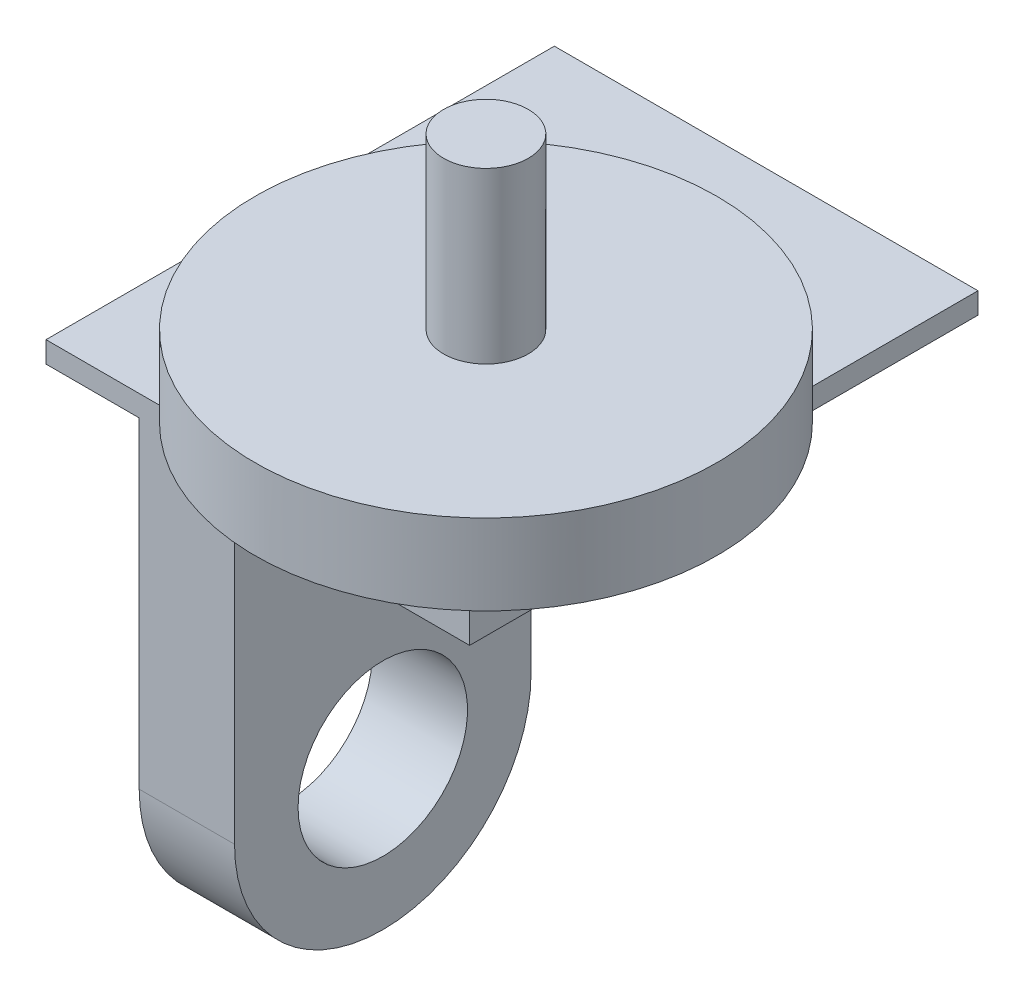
ISO-10303-21;
HEADER;
FILE_DESCRIPTION(('STEP AP214'),'2;1');
FILE_NAME('part.step','',(''),(''),'','','');
FILE_SCHEMA(('AUTOMOTIVE_DESIGN { 1 0 10303 214 1 1 1 1 }'));
ENDSEC;
DATA;
#1=APPLICATION_CONTEXT('core data for automotive mechanical design processes');
#2=APPLICATION_PROTOCOL_DEFINITION('international standard','automotive_design',2000,#1);
#3=PRODUCT_CONTEXT('',#1,'mechanical');
#4=PRODUCT('Part','Part','',(#3));
#5=PRODUCT_RELATED_PRODUCT_CATEGORY('part','',(#4));
#6=PRODUCT_DEFINITION_FORMATION('','',#4);
#7=PRODUCT_DEFINITION_CONTEXT('part definition',#1,'design');
#8=PRODUCT_DEFINITION('design','',#6,#7);
#9=PRODUCT_DEFINITION_SHAPE('','',#8);
#10=(LENGTH_UNIT() NAMED_UNIT(*) SI_UNIT(.MILLI.,.METRE.));
#11=(NAMED_UNIT(*) PLANE_ANGLE_UNIT() SI_UNIT($,.RADIAN.));
#12=(NAMED_UNIT(*) SI_UNIT($,.STERADIAN.) SOLID_ANGLE_UNIT());
#13=UNCERTAINTY_MEASURE_WITH_UNIT(LENGTH_MEASURE(1.E-05),#10,'distance_accuracy_value','');
#14=(GEOMETRIC_REPRESENTATION_CONTEXT(3) GLOBAL_UNCERTAINTY_ASSIGNED_CONTEXT((#13)) GLOBAL_UNIT_ASSIGNED_CONTEXT((#10,
#11,#12)) REPRESENTATION_CONTEXT('',''));
#15=CARTESIAN_POINT('',(0.,0.,0.));
#16=DIRECTION('',(0.,0.,1.));
#17=DIRECTION('',(1.,0.,0.));
#18=AXIS2_PLACEMENT_3D('',#15,#16,#17);
#19=CARTESIAN_POINT('',(0.,0.,0.));
#20=DIRECTION('',(1.,0.,0.));
#21=DIRECTION('',(0.,0.,-1.));
#22=AXIS2_PLACEMENT_3D('',#19,#20,#21);
#23=PLANE('',#22);
#24=CARTESIAN_POINT('',(0.,0.,0.));
#25=DIRECTION('',(1.,0.,0.));
#26=DIRECTION('',(0.,0.,-1.));
#27=AXIS2_PLACEMENT_3D('',#24,#25,#26);
#28=CIRCLE('',#27,40.);
#29=CARTESIAN_POINT('',(0.,0.,40.));
#30=VERTEX_POINT('',#29);
#31=EDGE_CURVE('E194',#30,#30,#28,.T.);
#32=ORIENTED_EDGE('',*,*,#31,.T.);
#33=EDGE_LOOP('',(#32));
#34=FACE_BOUND('',#33,.T.);
#35=DIRECTION('',(0.,0.,1.));
#36=VECTOR('',#35,1.);
#37=CARTESIAN_POINT('',(0.,151.8,0.));
#38=LINE('',#37,#36);
#39=CARTESIAN_POINT('',(0.,151.8,-70.));
#40=VERTEX_POINT('',#39);
#41=CARTESIAN_POINT('',(0.,151.8,70.));
#42=VERTEX_POINT('',#41);
#43=EDGE_CURVE('E171',#40,#42,#38,.T.);
#44=ORIENTED_EDGE('',*,*,#43,.F.);
#45=DIRECTION('',(0.,1.,0.));
#46=VECTOR('',#45,1.);
#47=CARTESIAN_POINT('',(0.,136.8,-70.));
#48=LINE('',#47,#46);
#49=CARTESIAN_POINT('',(0.,0.,-70.));
#50=VERTEX_POINT('',#49);
#51=EDGE_CURVE('E210',#50,#40,#48,.T.);
#52=ORIENTED_EDGE('',*,*,#51,.F.);
#53=CARTESIAN_POINT('',(0.,0.,0.));
#54=DIRECTION('',(1.,0.,0.));
#55=DIRECTION('',(0.,0.,-1.));
#56=AXIS2_PLACEMENT_3D('',#53,#54,#55);
#57=CIRCLE('',#56,70.);
#58=CARTESIAN_POINT('',(0.,0.,70.));
#59=VERTEX_POINT('',#58);
#60=EDGE_CURVE('E198',#59,#50,#57,.T.);
#61=ORIENTED_EDGE('',*,*,#60,.F.);
#62=DIRECTION('',(0.,-1.,0.));
#63=VECTOR('',#62,1.);
#64=CARTESIAN_POINT('',(0.,0.,70.));
#65=LINE('',#64,#63);
#66=EDGE_CURVE('E71',#42,#59,#65,.T.);
#67=ORIENTED_EDGE('',*,*,#66,.F.);
#68=EDGE_LOOP('',(#44,#52,#61,#67));
#69=FACE_BOUND('',#68,.T.);
#70=ADVANCED_FACE('F34',(#34,#69),#23,.F.);
#71=CARTESIAN_POINT('',(45.,136.8,-70.));
#72=DIRECTION('',(0.,0.,1.));
#73=DIRECTION('',(1.,0.,0.));
#74=AXIS2_PLACEMENT_3D('',#71,#72,#73);
#75=PLANE('',#74);
#76=DIRECTION('',(-1.,0.,0.));
#77=VECTOR('',#76,1.);
#78=CARTESIAN_POINT('',(0.,151.8,-70.));
#79=LINE('',#78,#77);
#80=CARTESIAN_POINT('',(156.,151.8,-70.));
#81=VERTEX_POINT('',#80);
#82=EDGE_CURVE('E173',#81,#40,#79,.T.);
#83=ORIENTED_EDGE('',*,*,#82,.F.);
#84=DIRECTION('',(0.,-1.,0.));
#85=VECTOR('',#84,1.);
#86=CARTESIAN_POINT('',(156.,161.8,-70.));
#87=LINE('',#86,#85);
#88=CARTESIAN_POINT('',(156.,136.8,-70.));
#89=VERTEX_POINT('',#88);
#90=EDGE_CURVE('E186',#81,#89,#87,.T.);
#91=ORIENTED_EDGE('',*,*,#90,.T.);
#92=DIRECTION('',(-1.,0.,0.));
#93=VECTOR('',#92,1.);
#94=CARTESIAN_POINT('',(0.,136.8,-70.));
#95=LINE('',#94,#93);
#96=CARTESIAN_POINT('',(45.,136.8,-70.));
#97=VERTEX_POINT('',#96);
#98=EDGE_CURVE('E138',#89,#97,#95,.T.);
#99=ORIENTED_EDGE('',*,*,#98,.T.);
#100=DIRECTION('',(0.,1.,0.));
#101=VECTOR('',#100,1.);
#102=CARTESIAN_POINT('',(45.,136.8,-70.));
#103=LINE('',#102,#101);
#104=CARTESIAN_POINT('',(45.,0.,-70.));
#105=VERTEX_POINT('',#104);
#106=EDGE_CURVE('E78',#105,#97,#103,.T.);
#107=ORIENTED_EDGE('',*,*,#106,.F.);
#108=DIRECTION('',(-1.,0.,0.));
#109=VECTOR('',#108,1.);
#110=CARTESIAN_POINT('',(45.,0.,-70.));
#111=LINE('',#110,#109);
#112=EDGE_CURVE('E42',#105,#50,#111,.T.);
#113=ORIENTED_EDGE('',*,*,#112,.T.);
#114=ORIENTED_EDGE('',*,*,#51,.T.);
#115=EDGE_LOOP('',(#83,#91,#99,#107,#113,#114));
#116=FACE_BOUND('',#115,.T.);
#117=ADVANCED_FACE('F216',(#116),#75,.F.);
#118=CARTESIAN_POINT('',(45.,0.,0.));
#119=DIRECTION('',(1.,0.,0.));
#120=DIRECTION('',(0.,0.,-1.));
#121=AXIS2_PLACEMENT_3D('',#118,#119,#120);
#122=PLANE('',#121);
#123=CARTESIAN_POINT('',(45.,0.,0.));
#124=DIRECTION('',(1.,0.,0.));
#125=DIRECTION('',(0.,0.,-1.));
#126=AXIS2_PLACEMENT_3D('',#123,#124,#125);
#127=CIRCLE('',#126,70.);
#128=CARTESIAN_POINT('',(45.,0.,70.));
#129=VERTEX_POINT('',#128);
#130=EDGE_CURVE('E201',#129,#105,#127,.T.);
#131=ORIENTED_EDGE('',*,*,#130,.T.);
#132=ORIENTED_EDGE('',*,*,#106,.T.);
#133=DIRECTION('',(0.,0.,1.));
#134=VECTOR('',#133,1.);
#135=CARTESIAN_POINT('',(45.,136.8,70.));
#136=LINE('',#135,#134);
#137=CARTESIAN_POINT('',(45.,136.8,70.));
#138=VERTEX_POINT('',#137);
#139=EDGE_CURVE('E204',#97,#138,#136,.T.);
#140=ORIENTED_EDGE('',*,*,#139,.T.);
#141=DIRECTION('',(0.,-1.,0.));
#142=VECTOR('',#141,1.);
#143=CARTESIAN_POINT('',(45.,0.,70.));
#144=LINE('',#143,#142);
#145=EDGE_CURVE('E56',#138,#129,#144,.T.);
#146=ORIENTED_EDGE('',*,*,#145,.T.);
#147=EDGE_LOOP('',(#131,#132,#140,#146));
#148=FACE_BOUND('',#147,.T.);
#149=CARTESIAN_POINT('',(45.,0.,0.));
#150=DIRECTION('',(1.,0.,0.));
#151=DIRECTION('',(0.,0.,-1.));
#152=AXIS2_PLACEMENT_3D('',#149,#150,#151);
#153=CIRCLE('',#152,40.);
#154=CARTESIAN_POINT('',(45.,0.,40.));
#155=VERTEX_POINT('',#154);
#156=EDGE_CURVE('E195',#155,#155,#153,.T.);
#157=ORIENTED_EDGE('',*,*,#156,.F.);
#158=EDGE_LOOP('',(#157));
#159=FACE_BOUND('',#158,.T.);
#160=ADVANCED_FACE('F239',(#148,#159),#122,.T.);
#161=CARTESIAN_POINT('',(45.,0.,0.));
#162=DIRECTION('',(-1.,0.,0.));
#163=DIRECTION('',(0.,0.,1.));
#164=AXIS2_PLACEMENT_3D('',#161,#162,#163);
#165=CYLINDRICAL_SURFACE('',#164,70.);
#166=ORIENTED_EDGE('',*,*,#60,.T.);
#167=ORIENTED_EDGE('',*,*,#112,.F.);
#168=ORIENTED_EDGE('',*,*,#130,.F.);
#169=DIRECTION('',(-1.,0.,0.));
#170=VECTOR('',#169,1.);
#171=CARTESIAN_POINT('',(45.,0.,70.));
#172=LINE('',#171,#170);
#173=EDGE_CURVE('E207',#129,#59,#172,.T.);
#174=ORIENTED_EDGE('',*,*,#173,.T.);
#175=EDGE_LOOP('',(#166,#167,#168,#174));
#176=FACE_BOUND('',#175,.T.);
#177=ADVANCED_FACE('F36',(#176),#165,.T.);
#178=CARTESIAN_POINT('',(45.,0.,70.));
#179=DIRECTION('',(0.,0.,-1.));
#180=DIRECTION('',(-1.,0.,0.));
#181=AXIS2_PLACEMENT_3D('',#178,#179,#180);
#182=PLANE('',#181);
#183=DIRECTION('',(1.,0.,0.));
#184=VECTOR('',#183,1.);
#185=CARTESIAN_POINT('',(0.,161.8,70.));
#186=LINE('',#185,#184);
#187=CARTESIAN_POINT('',(-44.,161.8,70.));
#188=VERTEX_POINT('',#187);
#189=CARTESIAN_POINT('',(10.1476212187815,161.799999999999,70.));
#190=VERTEX_POINT('',#189);
#191=EDGE_CURVE('E119',#188,#190,#186,.T.);
#192=ORIENTED_EDGE('',*,*,#191,.F.);
#193=DIRECTION('',(0.,1.,0.));
#194=VECTOR('',#193,1.);
#195=CARTESIAN_POINT('',(-44.,151.8,70.));
#196=LINE('',#195,#194);
#197=CARTESIAN_POINT('',(-44.,151.8,70.));
#198=VERTEX_POINT('',#197);
#199=EDGE_CURVE('E178',#198,#188,#196,.T.);
#200=ORIENTED_EDGE('',*,*,#199,.F.);
#201=DIRECTION('',(-1.,0.,0.));
#202=VECTOR('',#201,1.);
#203=CARTESIAN_POINT('',(0.,151.8,70.));
#204=LINE('',#203,#202);
#205=EDGE_CURVE('E169',#42,#198,#204,.T.);
#206=ORIENTED_EDGE('',*,*,#205,.F.);
#207=ORIENTED_EDGE('',*,*,#66,.T.);
#208=ORIENTED_EDGE('',*,*,#173,.F.);
#209=ORIENTED_EDGE('',*,*,#145,.F.);
#210=DIRECTION('',(1.,0.,0.));
#211=VECTOR('',#210,1.);
#212=CARTESIAN_POINT('',(0.,136.8,70.));
#213=LINE('',#212,#211);
#214=CARTESIAN_POINT('',(156.,136.8,70.));
#215=VERTEX_POINT('',#214);
#216=EDGE_CURVE('E180',#138,#215,#213,.T.);
#217=ORIENTED_EDGE('',*,*,#216,.T.);
#218=DIRECTION('',(0.,-1.,0.));
#219=VECTOR('',#218,1.);
#220=CARTESIAN_POINT('',(156.,161.8,70.));
#221=LINE('',#220,#219);
#222=CARTESIAN_POINT('',(156.,161.8,70.));
#223=VERTEX_POINT('',#222);
#224=EDGE_CURVE('E133',#223,#215,#221,.T.);
#225=ORIENTED_EDGE('',*,*,#224,.F.);
#226=EDGE_CURVE('E128',#190,#223,#186,.T.);
#227=ORIENTED_EDGE('',*,*,#226,.F.);
#228=EDGE_LOOP('',(#192,#200,#206,#207,#208,#209,#217,#225,#227));
#229=FACE_BOUND('',#228,.T.);
#230=ADVANCED_FACE('F131',(#229),#182,.F.);
#231=CARTESIAN_POINT('',(45.,0.,0.));
#232=DIRECTION('',(-1.,0.,0.));
#233=DIRECTION('',(0.,0.,1.));
#234=AXIS2_PLACEMENT_3D('',#231,#232,#233);
#235=CYLINDRICAL_SURFACE('',#234,40.);
#236=CARTESIAN_POINT('',(45.,0.,40.));
#237=CARTESIAN_POINT('',(44.53125,0.,40.));
#238=CARTESIAN_POINT('',(44.0625,0.,40.));
#239=CARTESIAN_POINT('',(43.125,0.,40.));
#240=CARTESIAN_POINT('',(42.65625,0.,40.));
#241=CARTESIAN_POINT('',(41.71875,0.,40.));
#242=CARTESIAN_POINT('',(41.25,0.,40.));
#243=CARTESIAN_POINT('',(40.3125,0.,40.));
#244=CARTESIAN_POINT('',(39.84375,0.,40.));
#245=CARTESIAN_POINT('',(38.90625,0.,40.));
#246=CARTESIAN_POINT('',(38.4375,0.,40.));
#247=CARTESIAN_POINT('',(37.5,0.,40.));
#248=CARTESIAN_POINT('',(37.03125,0.,40.));
#249=CARTESIAN_POINT('',(36.09375,0.,40.));
#250=CARTESIAN_POINT('',(35.625,0.,40.));
#251=CARTESIAN_POINT('',(34.6875,0.,40.));
#252=CARTESIAN_POINT('',(34.21875,0.,40.));
#253=CARTESIAN_POINT('',(33.28125,0.,40.));
#254=CARTESIAN_POINT('',(32.8125,0.,40.));
#255=CARTESIAN_POINT('',(31.875,0.,40.));
#256=CARTESIAN_POINT('',(31.40625,0.,40.));
#257=CARTESIAN_POINT('',(30.46875,0.,40.));
#258=CARTESIAN_POINT('',(30.,0.,40.));
#259=CARTESIAN_POINT('',(29.0625,0.,40.));
#260=CARTESIAN_POINT('',(28.59375,0.,40.));
#261=CARTESIAN_POINT('',(27.65625,0.,40.));
#262=CARTESIAN_POINT('',(27.1875,0.,40.));
#263=CARTESIAN_POINT('',(26.25,0.,40.));
#264=CARTESIAN_POINT('',(25.78125,0.,40.));
#265=CARTESIAN_POINT('',(24.84375,0.,40.));
#266=CARTESIAN_POINT('',(24.375,0.,40.));
#267=CARTESIAN_POINT('',(23.4375,0.,40.));
#268=CARTESIAN_POINT('',(22.96875,0.,40.));
#269=CARTESIAN_POINT('',(22.03125,0.,40.));
#270=CARTESIAN_POINT('',(21.5625,0.,40.));
#271=CARTESIAN_POINT('',(20.625,0.,40.));
#272=CARTESIAN_POINT('',(20.15625,0.,40.));
#273=CARTESIAN_POINT('',(19.21875,0.,40.));
#274=CARTESIAN_POINT('',(18.75,0.,40.));
#275=CARTESIAN_POINT('',(17.8125,0.,40.));
#276=CARTESIAN_POINT('',(17.34375,0.,40.));
#277=CARTESIAN_POINT('',(16.40625,0.,40.));
#278=CARTESIAN_POINT('',(15.9375,0.,40.));
#279=CARTESIAN_POINT('',(15.,0.,40.));
#280=CARTESIAN_POINT('',(14.53125,0.,40.));
#281=CARTESIAN_POINT('',(13.59375,0.,40.));
#282=CARTESIAN_POINT('',(13.125,0.,40.));
#283=CARTESIAN_POINT('',(12.1875,0.,40.));
#284=CARTESIAN_POINT('',(11.71875,0.,40.));
#285=CARTESIAN_POINT('',(10.78125,0.,40.));
#286=CARTESIAN_POINT('',(10.3125,0.,40.));
#287=CARTESIAN_POINT('',(9.375,0.,40.));
#288=CARTESIAN_POINT('',(8.90625,0.,40.));
#289=CARTESIAN_POINT('',(7.96874999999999,0.,40.));
#290=CARTESIAN_POINT('',(7.5,0.,40.));
#291=CARTESIAN_POINT('',(6.5625,0.,40.));
#292=CARTESIAN_POINT('',(6.09375,0.,40.));
#293=CARTESIAN_POINT('',(5.15625,0.,40.));
#294=CARTESIAN_POINT('',(4.68749999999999,0.,40.));
#295=CARTESIAN_POINT('',(3.74999999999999,0.,40.));
#296=CARTESIAN_POINT('',(3.28124999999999,0.,40.));
#297=CARTESIAN_POINT('',(2.34374999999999,0.,40.));
#298=CARTESIAN_POINT('',(1.87499999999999,0.,40.));
#299=CARTESIAN_POINT('',(0.937499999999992,0.,40.));
#300=CARTESIAN_POINT('',(0.468749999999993,0.,40.));
#301=CARTESIAN_POINT('',(0.,0.,40.));
#302=B_SPLINE_CURVE_WITH_KNOTS('',3,(#236,#237,#238,#239,#240,#241,#242,#243,#244,#245,#246,
#247,#248,#249,#250,#251,#252,#253,#254,#255,#256,#257,#258,#259,#260,#261,#262,#263,#264,#265,
#266,#267,#268,#269,#270,#271,#272,#273,#274,#275,#276,#277,#278,#279,#280,#281,#282,#283,#284,
#285,#286,#287,#288,#289,#290,#291,#292,#293,#294,#295,#296,#297,#298,#299,#300,#301),
.UNSPECIFIED.,.F.,.F.,(4,2,2,2,2,2,2,2,2,2,2,2,2,2,2,2,2,2,2,2,2,2,2,2,2,2,2,2,2,2,2,2,4),(0.,
1.40625,2.8125,4.21875000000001,5.62500000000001,7.03125,8.4375,9.84375000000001,11.25,12.65625,
14.0625,15.46875,16.875,18.28125,19.6875,21.09375,22.5,23.90625,25.3125,26.71875,28.125,
29.53125,30.9375,32.34375,33.75,35.15625,36.5625,37.96875,39.375,40.78125,42.1875,43.59375,45.),.UNSPECIFIED.);
#303=EDGE_CURVE('BSEAM263',#155,#30,#302,.T.);
#304=ORIENTED_EDGE('',*,*,#156,.T.);
#305=ORIENTED_EDGE('',*,*,#31,.F.);
#306=ORIENTED_EDGE('',*,*,#303,.T.);
#307=ORIENTED_EDGE('',*,*,#303,.F.);
#308=EDGE_LOOP('',(#304,#306,#305,#307));
#309=FACE_BOUND('',#308,.T.);
#310=ADVANCED_FACE('F263',(#309),#235,.F.);
#311=CARTESIAN_POINT('',(156.,161.8,-70.));
#312=DIRECTION('',(-1.,0.,0.));
#313=DIRECTION('',(0.,0.,1.));
#314=AXIS2_PLACEMENT_3D('',#311,#312,#313);
#315=PLANE('',#314);
#316=DIRECTION('',(0.,0.,-1.));
#317=VECTOR('',#316,1.);
#318=CARTESIAN_POINT('',(156.,136.8,-70.));
#319=LINE('',#318,#317);
#320=EDGE_CURVE('E188',#215,#89,#319,.T.);
#321=ORIENTED_EDGE('',*,*,#320,.T.);
#322=ORIENTED_EDGE('',*,*,#90,.F.);
#323=DIRECTION('',(0.,0.,1.));
#324=VECTOR('',#323,1.);
#325=CARTESIAN_POINT('',(156.,151.8,0.));
#326=LINE('',#325,#324);
#327=CARTESIAN_POINT('',(156.,151.8,-170.));
#328=VERTEX_POINT('',#327);
#329=EDGE_CURVE('E162',#328,#81,#326,.T.);
#330=ORIENTED_EDGE('',*,*,#329,.F.);
#331=DIRECTION('',(0.,1.,0.));
#332=VECTOR('',#331,1.);
#333=CARTESIAN_POINT('',(156.,151.8,-170.));
#334=LINE('',#333,#332);
#335=CARTESIAN_POINT('',(156.,161.8,-170.));
#336=VERTEX_POINT('',#335);
#337=EDGE_CURVE('E175',#328,#336,#334,.T.);
#338=ORIENTED_EDGE('',*,*,#337,.T.);
#339=DIRECTION('',(0.,0.,-1.));
#340=VECTOR('',#339,1.);
#341=CARTESIAN_POINT('',(156.,161.8,-70.));
#342=LINE('',#341,#340);
#343=CARTESIAN_POINT('',(156.,161.8,-89.4410979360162));
#344=VERTEX_POINT('',#343);
#345=EDGE_CURVE('E127',#344,#336,#342,.T.);
#346=ORIENTED_EDGE('',*,*,#345,.F.);
#347=EDGE_CURVE('E144',#223,#344,#342,.T.);
#348=ORIENTED_EDGE('',*,*,#347,.F.);
#349=ORIENTED_EDGE('',*,*,#224,.T.);
#350=EDGE_LOOP('',(#321,#322,#330,#338,#346,#348,#349));
#351=FACE_BOUND('',#350,.T.);
#352=ADVANCED_FACE('F235',(#351),#315,.F.);
#353=CARTESIAN_POINT('',(0.,161.8,0.));
#354=DIRECTION('',(0.,1.,0.));
#355=DIRECTION('',(0.,0.,1.));
#356=AXIS2_PLACEMENT_3D('',#353,#354,#355);
#357=PLANE('',#356);
#358=CARTESIAN_POINT('',(93.7,161.8,5.55014288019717E-13));
#359=DIRECTION('',(0.,1.,0.));
#360=DIRECTION('',(0.,0.,1.));
#361=AXIS2_PLACEMENT_3D('',#358,#359,#360);
#362=CIRCLE('',#361,109.000000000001);
#363=EDGE_CURVE('E11',#344,#190,#362,.T.);
#364=ORIENTED_EDGE('',*,*,#363,.F.);
#365=ORIENTED_EDGE('',*,*,#345,.T.);
#366=DIRECTION('',(-1.,0.,0.));
#367=VECTOR('',#366,1.);
#368=CARTESIAN_POINT('',(0.,161.8,-170.));
#369=LINE('',#368,#367);
#370=CARTESIAN_POINT('',(-44.,161.8,-170.));
#371=VERTEX_POINT('',#370);
#372=EDGE_CURVE('E161',#336,#371,#369,.T.);
#373=ORIENTED_EDGE('',*,*,#372,.T.);
#374=DIRECTION('',(0.,0.,-1.));
#375=VECTOR('',#374,1.);
#376=CARTESIAN_POINT('',(-44.,161.8,0.));
#377=LINE('',#376,#375);
#378=EDGE_CURVE('E124',#188,#371,#377,.T.);
#379=ORIENTED_EDGE('',*,*,#378,.F.);
#380=ORIENTED_EDGE('',*,*,#191,.T.);
#381=EDGE_LOOP('',(#364,#365,#373,#379,#380));
#382=FACE_BOUND('',#381,.T.);
#383=ADVANCED_FACE('F121',(#382),#357,.T.);
#384=CARTESIAN_POINT('',(0.,136.8,0.));
#385=DIRECTION('',(0.,1.,0.));
#386=DIRECTION('',(0.,0.,1.));
#387=AXIS2_PLACEMENT_3D('',#384,#385,#386);
#388=PLANE('',#387);
#389=CARTESIAN_POINT('',(93.7,136.8,4.69258063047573E-13));
#390=DIRECTION('',(0.,-1.,0.));
#391=DIRECTION('',(0.,0.,-1.));
#392=AXIS2_PLACEMENT_3D('',#389,#390,#391);
#393=CIRCLE('',#392,48.0000000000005);
#394=CARTESIAN_POINT('',(93.7,136.8,-48.));
#395=VERTEX_POINT('',#394);
#396=EDGE_CURVE('E146',#395,#395,#393,.T.);
#397=ORIENTED_EDGE('',*,*,#396,.F.);
#398=EDGE_LOOP('',(#397));
#399=FACE_BOUND('',#398,.T.);
#400=ORIENTED_EDGE('',*,*,#139,.F.);
#401=ORIENTED_EDGE('',*,*,#98,.F.);
#402=ORIENTED_EDGE('',*,*,#320,.F.);
#403=ORIENTED_EDGE('',*,*,#216,.F.);
#404=EDGE_LOOP('',(#400,#401,#402,#403));
#405=FACE_BOUND('',#404,.T.);
#406=ADVANCED_FACE('F241',(#399,#405),#388,.F.);
#407=CARTESIAN_POINT('',(-44.,151.8,0.));
#408=DIRECTION('',(1.,0.,0.));
#409=DIRECTION('',(0.,0.,-1.));
#410=AXIS2_PLACEMENT_3D('',#407,#408,#409);
#411=PLANE('',#410);
#412=ORIENTED_EDGE('',*,*,#378,.T.);
#413=DIRECTION('',(0.,1.,0.));
#414=VECTOR('',#413,1.);
#415=CARTESIAN_POINT('',(-44.,151.8,-170.));
#416=LINE('',#415,#414);
#417=CARTESIAN_POINT('',(-44.,151.8,-170.));
#418=VERTEX_POINT('',#417);
#419=EDGE_CURVE('E181',#418,#371,#416,.T.);
#420=ORIENTED_EDGE('',*,*,#419,.F.);
#421=DIRECTION('',(0.,0.,-1.));
#422=VECTOR('',#421,1.);
#423=CARTESIAN_POINT('',(-44.,151.8,0.));
#424=LINE('',#423,#422);
#425=EDGE_CURVE('E167',#198,#418,#424,.T.);
#426=ORIENTED_EDGE('',*,*,#425,.F.);
#427=ORIENTED_EDGE('',*,*,#199,.T.);
#428=EDGE_LOOP('',(#412,#420,#426,#427));
#429=FACE_BOUND('',#428,.T.);
#430=ADVANCED_FACE('F227',(#429),#411,.F.);
#431=CARTESIAN_POINT('',(0.,151.8,-170.));
#432=DIRECTION('',(0.,0.,-1.));
#433=DIRECTION('',(-1.,0.,0.));
#434=AXIS2_PLACEMENT_3D('',#431,#432,#433);
#435=PLANE('',#434);
#436=ORIENTED_EDGE('',*,*,#372,.F.);
#437=ORIENTED_EDGE('',*,*,#337,.F.);
#438=DIRECTION('',(-1.,0.,0.));
#439=VECTOR('',#438,1.);
#440=CARTESIAN_POINT('',(0.,151.8,-170.));
#441=LINE('',#440,#439);
#442=EDGE_CURVE('E164',#328,#418,#441,.T.);
#443=ORIENTED_EDGE('',*,*,#442,.T.);
#444=ORIENTED_EDGE('',*,*,#419,.T.);
#445=EDGE_LOOP('',(#436,#437,#443,#444));
#446=FACE_BOUND('',#445,.T.);
#447=ADVANCED_FACE('F232',(#446),#435,.T.);
#448=CARTESIAN_POINT('',(0.,151.8,0.));
#449=DIRECTION('',(0.,1.,0.));
#450=DIRECTION('',(0.,0.,1.));
#451=AXIS2_PLACEMENT_3D('',#448,#449,#450);
#452=PLANE('',#451);
#453=ORIENTED_EDGE('',*,*,#329,.T.);
#454=ORIENTED_EDGE('',*,*,#82,.T.);
#455=ORIENTED_EDGE('',*,*,#43,.T.);
#456=ORIENTED_EDGE('',*,*,#205,.T.);
#457=ORIENTED_EDGE('',*,*,#425,.T.);
#458=ORIENTED_EDGE('',*,*,#442,.F.);
#459=EDGE_LOOP('',(#453,#454,#455,#456,#457,#458));
#460=FACE_BOUND('',#459,.T.);
#461=ADVANCED_FACE('F223',(#460),#452,.F.);
#462=CARTESIAN_POINT('',(93.7,131.8,0.));
#463=DIRECTION('',(0.,-1.,0.));
#464=DIRECTION('',(0.,0.,-1.));
#465=AXIS2_PLACEMENT_3D('',#462,#463,#464);
#466=PLANE('',#465);
#467=CARTESIAN_POINT('',(93.7,131.8,4.52106818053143E-13));
#468=DIRECTION('',(0.,-1.,0.));
#469=DIRECTION('',(0.,0.,-1.));
#470=AXIS2_PLACEMENT_3D('',#467,#468,#469);
#471=CIRCLE('',#470,48.0000000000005);
#472=CARTESIAN_POINT('',(93.7,131.8,-48.));
#473=VERTEX_POINT('',#472);
#474=EDGE_CURVE('E152',#473,#473,#471,.T.);
#475=ORIENTED_EDGE('',*,*,#474,.T.);
#476=EDGE_LOOP('',(#475));
#477=FACE_BOUND('',#476,.T.);
#478=ADVANCED_FACE('F307',(#477),#466,.T.);
#479=CARTESIAN_POINT('',(93.7,-1000.,-3.43024899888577E-12));
#480=DIRECTION('',(0.,-1.,0.));
#481=DIRECTION('',(0.,0.,-1.));
#482=AXIS2_PLACEMENT_3D('',#479,#480,#481);
#483=CYLINDRICAL_SURFACE('',#482,48.0000000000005);
#484=ORIENTED_EDGE('',*,*,#396,.T.);
#485=EDGE_LOOP('',(#484));
#486=FACE_BOUND('',#485,.T.);
#487=ORIENTED_EDGE('',*,*,#474,.F.);
#488=EDGE_LOOP('',(#487));
#489=FACE_BOUND('',#488,.T.);
#490=ADVANCED_FACE('F341',(#486,#489),#483,.T.);
#491=CARTESIAN_POINT('',(93.7,161.8,-109.));
#492=DIRECTION('',(0.,-1.,0.));
#493=DIRECTION('',(0.,0.,-1.));
#494=AXIS2_PLACEMENT_3D('',#491,#492,#493);
#495=PLANE('',#494);
#496=ORIENTED_EDGE('',*,*,#226,.T.);
#497=ORIENTED_EDGE('',*,*,#347,.T.);
#498=CARTESIAN_POINT('',(93.7,161.799999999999,5.55014288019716E-13));
#499=DIRECTION('',(0.,-1.,0.));
#500=DIRECTION('',(0.,0.,-1.));
#501=AXIS2_PLACEMENT_3D('',#498,#499,#500);
#502=CIRCLE('',#501,109.000000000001);
#503=EDGE_CURVE('E142',#344,#190,#502,.T.);
#504=ORIENTED_EDGE('',*,*,#503,.T.);
#505=EDGE_LOOP('',(#496,#497,#504));
#506=FACE_BOUND('',#505,.T.);
#507=ADVANCED_FACE('F143',(#506),#495,.T.);
#508=CARTESIAN_POINT('',(93.7,279.8,0.));
#509=DIRECTION('',(0.,1.,0.));
#510=DIRECTION('',(0.,0.,1.));
#511=AXIS2_PLACEMENT_3D('',#508,#509,#510);
#512=PLANE('',#511);
#513=CARTESIAN_POINT('',(93.7,279.8,9.59783669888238E-13));
#514=DIRECTION('',(0.,-1.,0.));
#515=DIRECTION('',(0.,0.,-1.));
#516=AXIS2_PLACEMENT_3D('',#513,#514,#515);
#517=CIRCLE('',#516,20.000000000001);
#518=CARTESIAN_POINT('',(93.7,279.8,-20.));
#519=VERTEX_POINT('',#518);
#520=EDGE_CURVE('E158',#519,#519,#517,.T.);
#521=ORIENTED_EDGE('',*,*,#520,.F.);
#522=EDGE_LOOP('',(#521));
#523=FACE_BOUND('',#522,.T.);
#524=ADVANCED_FACE('F360',(#523),#512,.T.);
#525=CARTESIAN_POINT('',(93.7,-1000.,-3.43024899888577E-12));
#526=DIRECTION('',(0.,-1.,0.));
#527=DIRECTION('',(0.,0.,-1.));
#528=AXIS2_PLACEMENT_3D('',#525,#526,#527);
#529=CYLINDRICAL_SURFACE('',#528,20.0000000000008);
#530=ORIENTED_EDGE('',*,*,#520,.T.);
#531=EDGE_LOOP('',(#530));
#532=FACE_BOUND('',#531,.T.);
#533=CARTESIAN_POINT('',(93.7,199.8,6.85363749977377E-13));
#534=DIRECTION('',(0.,-1.,0.));
#535=DIRECTION('',(0.,0.,-1.));
#536=AXIS2_PLACEMENT_3D('',#533,#534,#535);
#537=CIRCLE('',#536,20.0000000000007);
#538=CARTESIAN_POINT('',(93.7,199.8,-20.));
#539=VERTEX_POINT('',#538);
#540=EDGE_CURVE('E149',#539,#539,#537,.T.);
#541=ORIENTED_EDGE('',*,*,#540,.F.);
#542=EDGE_LOOP('',(#541));
#543=FACE_BOUND('',#542,.T.);
#544=ADVANCED_FACE('F369',(#532,#543),#529,.T.);
#545=CARTESIAN_POINT('',(93.7,199.8,-20.));
#546=DIRECTION('',(0.,1.,0.));
#547=DIRECTION('',(0.,0.,1.));
#548=AXIS2_PLACEMENT_3D('',#545,#546,#547);
#549=PLANE('',#548);
#550=ORIENTED_EDGE('',*,*,#540,.T.);
#551=EDGE_LOOP('',(#550));
#552=FACE_BOUND('',#551,.T.);
#553=CARTESIAN_POINT('',(93.7,199.8,6.85363749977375E-13));
#554=DIRECTION('',(0.,-1.,0.));
#555=DIRECTION('',(0.,0.,-1.));
#556=AXIS2_PLACEMENT_3D('',#553,#554,#555);
#557=CIRCLE('',#556,109.000000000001);
#558=CARTESIAN_POINT('',(93.7,199.8,-109.));
#559=VERTEX_POINT('',#558);
#560=EDGE_CURVE('E145',#559,#559,#557,.T.);
#561=ORIENTED_EDGE('',*,*,#560,.F.);
#562=EDGE_LOOP('',(#561));
#563=FACE_BOUND('',#562,.T.);
#564=ADVANCED_FACE('F379',(#552,#563),#549,.T.);
#565=CARTESIAN_POINT('',(93.7,-1000.,-3.43024899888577E-12));
#566=DIRECTION('',(0.,-1.,0.));
#567=DIRECTION('',(0.,0.,-1.));
#568=AXIS2_PLACEMENT_3D('',#565,#566,#567);
#569=CYLINDRICAL_SURFACE('',#568,109.000000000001);
#570=ORIENTED_EDGE('',*,*,#560,.T.);
#571=EDGE_LOOP('',(#570));
#572=FACE_BOUND('',#571,.T.);
#573=ORIENTED_EDGE('',*,*,#503,.F.);
#574=ORIENTED_EDGE('',*,*,#363,.T.);
#575=EDGE_LOOP('',(#573,#574));
#576=FACE_BOUND('',#575,.T.);
#577=ADVANCED_FACE('F141',(#572,#576),#569,.T.);
#578=CLOSED_SHELL('',(#70,#117,#160,#177,#230,#310,#352,#383,#406,#430,#447,#461,#478,#490,#507,
#524,#544,#564,#577));
#579=MANIFOLD_SOLID_BREP('B2',#578);
#580=ADVANCED_BREP_SHAPE_REPRESENTATION('',(#18,#579),#14);
#581=SHAPE_DEFINITION_REPRESENTATION(#9,#580);
ENDSEC;
END-ISO-10303-21;
